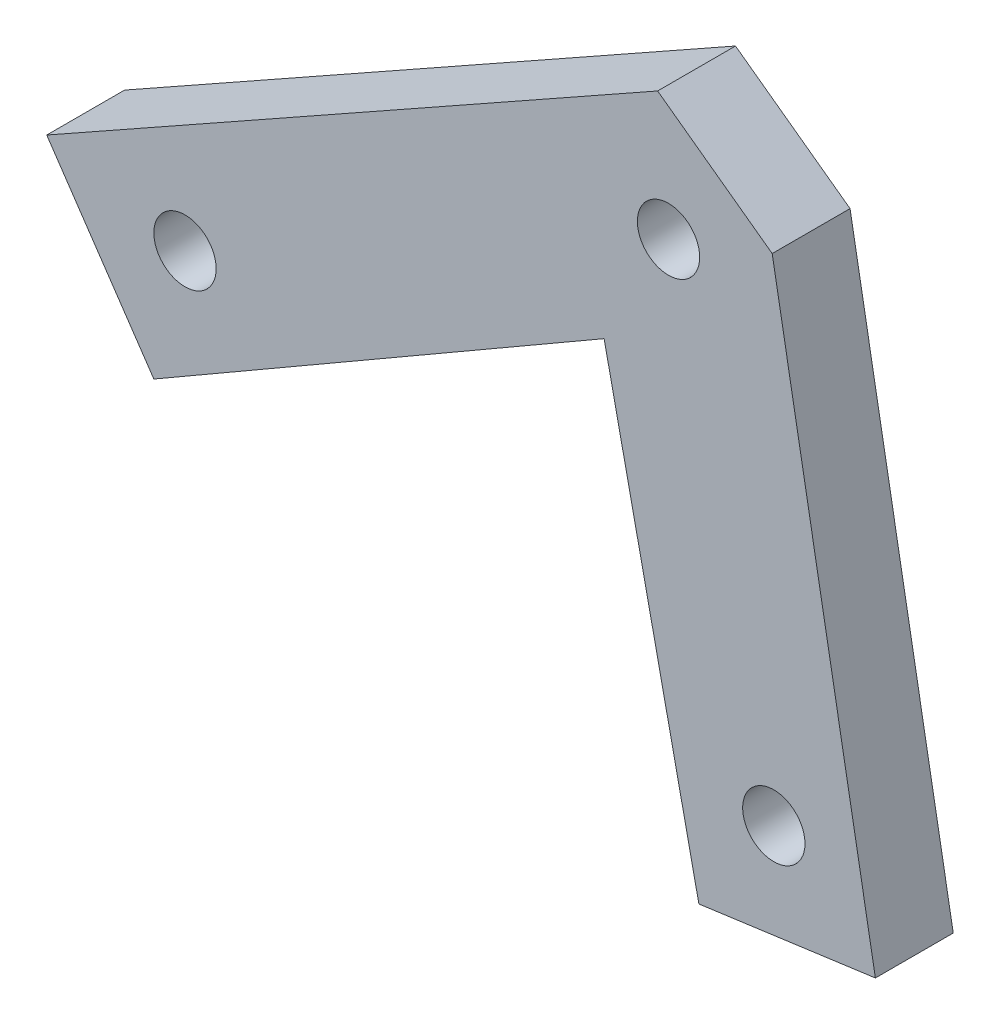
from build123d import *

# Parameters (mm, degrees)
SKETCH1_R           = 2.54
BOSS_EXTRUDE1_DEPTH = 6.35


with BuildPart() as part:
    # Sketch1 → Boss-Extrude1 (new body)
    with BuildSketch(Plane.XY):
        Polygon((-37.77087539, -4.481560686), (-29.03645542, -17.34644163), (7.680110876, 3.864018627), (15.406778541, -32.19376381), (29.799590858, -30.224221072), (21.38419086, 16.726501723), (12.042995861, 23.537423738), align=None)
        with Locations((-26.49645542, -7.021560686)):
            Circle(SKETCH1_R, mode=Mode.SUBTRACT)
        with Locations((12.930131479, 13.505171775)):
            Circle(SKETCH1_R, mode=Mode.SUBTRACT)
        with Locations((21.517225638, -23.614523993)):
            Circle(SKETCH1_R, mode=Mode.SUBTRACT)
    extrude(amount=BOSS_EXTRUDE1_DEPTH)


solid = part.part
